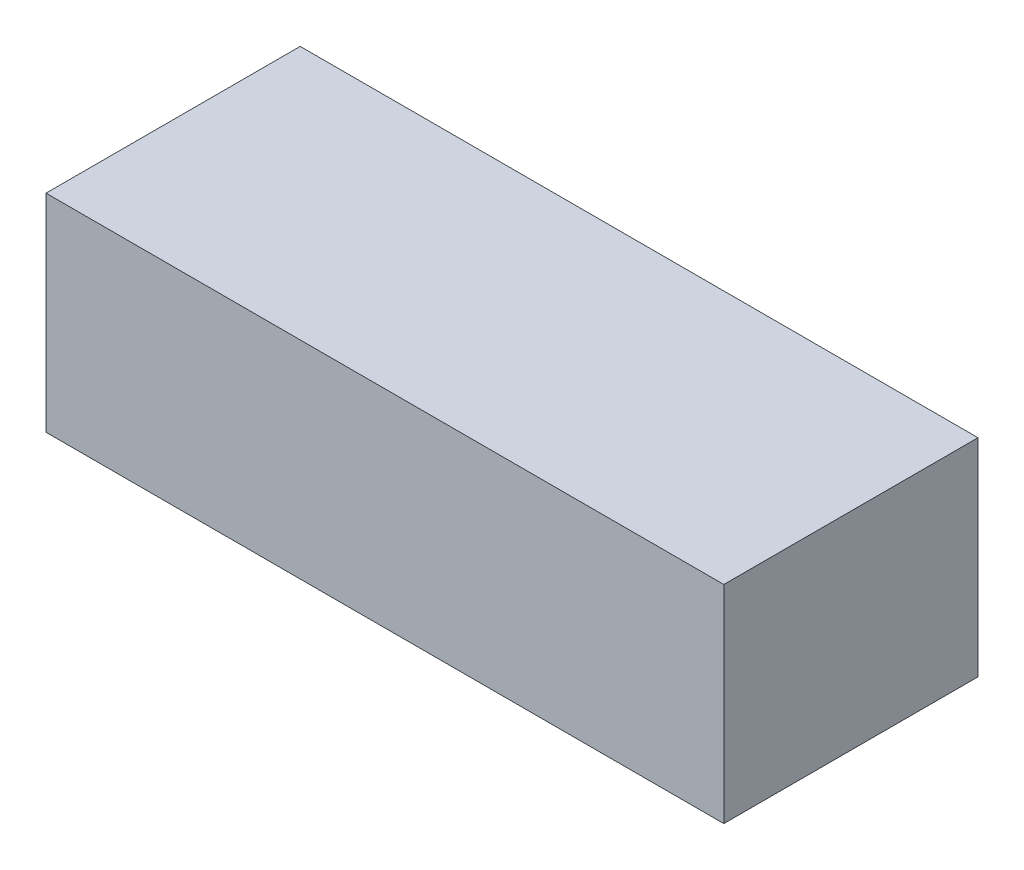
ISO-10303-21;
HEADER;
FILE_DESCRIPTION(('STEP AP214'),'2;1');
FILE_NAME('part.step','',(''),(''),'','','');
FILE_SCHEMA(('AUTOMOTIVE_DESIGN { 1 0 10303 214 1 1 1 1 }'));
ENDSEC;
DATA;
#1=APPLICATION_CONTEXT('core data for automotive mechanical design processes');
#2=APPLICATION_PROTOCOL_DEFINITION('international standard','automotive_design',2000,#1);
#3=PRODUCT_CONTEXT('',#1,'mechanical');
#4=PRODUCT('Part','Part','',(#3));
#5=PRODUCT_RELATED_PRODUCT_CATEGORY('part','',(#4));
#6=PRODUCT_DEFINITION_FORMATION('','',#4);
#7=PRODUCT_DEFINITION_CONTEXT('part definition',#1,'design');
#8=PRODUCT_DEFINITION('design','',#6,#7);
#9=PRODUCT_DEFINITION_SHAPE('','',#8);
#10=(LENGTH_UNIT() NAMED_UNIT(*) SI_UNIT(.MILLI.,.METRE.));
#11=(NAMED_UNIT(*) PLANE_ANGLE_UNIT() SI_UNIT($,.RADIAN.));
#12=(NAMED_UNIT(*) SI_UNIT($,.STERADIAN.) SOLID_ANGLE_UNIT());
#13=UNCERTAINTY_MEASURE_WITH_UNIT(LENGTH_MEASURE(1.E-05),#10,'distance_accuracy_value','');
#14=(GEOMETRIC_REPRESENTATION_CONTEXT(3) GLOBAL_UNCERTAINTY_ASSIGNED_CONTEXT((#13)) GLOBAL_UNIT_ASSIGNED_CONTEXT((#10,
#11,#12)) REPRESENTATION_CONTEXT('',''));
#15=CARTESIAN_POINT('',(0.,0.,0.));
#16=DIRECTION('',(0.,0.,1.));
#17=DIRECTION('',(1.,0.,0.));
#18=AXIS2_PLACEMENT_3D('',#15,#16,#17);
#19=CARTESIAN_POINT('',(0.,0.,13.5));
#20=DIRECTION('',(-1.,0.,0.));
#21=DIRECTION('',(0.,0.,1.));
#22=AXIS2_PLACEMENT_3D('',#19,#20,#21);
#23=PLANE('',#22);
#24=DIRECTION('',(0.,1.,0.));
#25=VECTOR('',#24,1.);
#26=CARTESIAN_POINT('',(0.,0.,0.));
#27=LINE('',#26,#25);
#28=CARTESIAN_POINT('',(0.,0.,0.));
#29=VERTEX_POINT('',#28);
#30=CARTESIAN_POINT('',(0.,11.,0.));
#31=VERTEX_POINT('',#30);
#32=EDGE_CURVE('E99',#29,#31,#27,.T.);
#33=ORIENTED_EDGE('',*,*,#32,.F.);
#34=DIRECTION('',(0.,0.,-1.));
#35=VECTOR('',#34,1.);
#36=CARTESIAN_POINT('',(0.,0.,13.5));
#37=LINE('',#36,#35);
#38=CARTESIAN_POINT('',(0.,0.,13.5));
#39=VERTEX_POINT('',#38);
#40=EDGE_CURVE('E11',#39,#29,#37,.T.);
#41=ORIENTED_EDGE('',*,*,#40,.F.);
#42=DIRECTION('',(0.,1.,0.));
#43=VECTOR('',#42,1.);
#44=CARTESIAN_POINT('',(0.,0.,13.5));
#45=LINE('',#44,#43);
#46=CARTESIAN_POINT('',(0.,11.,13.5));
#47=VERTEX_POINT('',#46);
#48=EDGE_CURVE('E94',#39,#47,#45,.T.);
#49=ORIENTED_EDGE('',*,*,#48,.T.);
#50=DIRECTION('',(0.,0.,-1.));
#51=VECTOR('',#50,1.);
#52=CARTESIAN_POINT('',(0.,11.,13.5));
#53=LINE('',#52,#51);
#54=EDGE_CURVE('E37',#47,#31,#53,.T.);
#55=ORIENTED_EDGE('',*,*,#54,.T.);
#56=EDGE_LOOP('',(#33,#41,#49,#55));
#57=FACE_BOUND('',#56,.T.);
#58=ADVANCED_FACE('F34',(#57),#23,.T.);
#59=CARTESIAN_POINT('',(0.,0.,13.5));
#60=DIRECTION('',(0.,1.,0.));
#61=DIRECTION('',(0.,0.,1.));
#62=AXIS2_PLACEMENT_3D('',#59,#60,#61);
#63=PLANE('',#62);
#64=DIRECTION('',(1.,0.,0.));
#65=VECTOR('',#64,1.);
#66=CARTESIAN_POINT('',(0.,0.,0.));
#67=LINE('',#66,#65);
#68=CARTESIAN_POINT('',(36.,0.,0.));
#69=VERTEX_POINT('',#68);
#70=EDGE_CURVE('E67',#29,#69,#67,.T.);
#71=ORIENTED_EDGE('',*,*,#70,.T.);
#72=DIRECTION('',(0.,0.,-1.));
#73=VECTOR('',#72,1.);
#74=CARTESIAN_POINT('',(36.,0.,13.5));
#75=LINE('',#74,#73);
#76=CARTESIAN_POINT('',(36.,0.,13.5));
#77=VERTEX_POINT('',#76);
#78=EDGE_CURVE('E43',#77,#69,#75,.T.);
#79=ORIENTED_EDGE('',*,*,#78,.F.);
#80=DIRECTION('',(1.,0.,0.));
#81=VECTOR('',#80,1.);
#82=CARTESIAN_POINT('',(0.,0.,13.5));
#83=LINE('',#82,#81);
#84=EDGE_CURVE('E84',#39,#77,#83,.T.);
#85=ORIENTED_EDGE('',*,*,#84,.F.);
#86=ORIENTED_EDGE('',*,*,#40,.T.);
#87=EDGE_LOOP('',(#71,#79,#85,#86));
#88=FACE_BOUND('',#87,.T.);
#89=ADVANCED_FACE('F109',(#88),#63,.F.);
#90=CARTESIAN_POINT('',(36.,0.,13.5));
#91=DIRECTION('',(-1.,0.,0.));
#92=DIRECTION('',(0.,0.,1.));
#93=AXIS2_PLACEMENT_3D('',#90,#91,#92);
#94=PLANE('',#93);
#95=DIRECTION('',(0.,1.,0.));
#96=VECTOR('',#95,1.);
#97=CARTESIAN_POINT('',(36.,0.,0.));
#98=LINE('',#97,#96);
#99=CARTESIAN_POINT('',(36.,11.,0.));
#100=VERTEX_POINT('',#99);
#101=EDGE_CURVE('E91',#69,#100,#98,.T.);
#102=ORIENTED_EDGE('',*,*,#101,.T.);
#103=DIRECTION('',(0.,0.,-1.));
#104=VECTOR('',#103,1.);
#105=CARTESIAN_POINT('',(36.,11.,13.5));
#106=LINE('',#105,#104);
#107=CARTESIAN_POINT('',(36.,11.,13.5));
#108=VERTEX_POINT('',#107);
#109=EDGE_CURVE('E88',#108,#100,#106,.T.);
#110=ORIENTED_EDGE('',*,*,#109,.F.);
#111=DIRECTION('',(0.,1.,0.));
#112=VECTOR('',#111,1.);
#113=CARTESIAN_POINT('',(36.,0.,13.5));
#114=LINE('',#113,#112);
#115=EDGE_CURVE('E79',#77,#108,#114,.T.);
#116=ORIENTED_EDGE('',*,*,#115,.F.);
#117=ORIENTED_EDGE('',*,*,#78,.T.);
#118=EDGE_LOOP('',(#102,#110,#116,#117));
#119=FACE_BOUND('',#118,.T.);
#120=ADVANCED_FACE('F89',(#119),#94,.F.);
#121=CARTESIAN_POINT('',(0.,11.,13.5));
#122=DIRECTION('',(0.,1.,0.));
#123=DIRECTION('',(0.,0.,1.));
#124=AXIS2_PLACEMENT_3D('',#121,#122,#123);
#125=PLANE('',#124);
#126=DIRECTION('',(1.,0.,0.));
#127=VECTOR('',#126,1.);
#128=CARTESIAN_POINT('',(0.,11.,0.));
#129=LINE('',#128,#127);
#130=EDGE_CURVE('E102',#31,#100,#129,.T.);
#131=ORIENTED_EDGE('',*,*,#130,.F.);
#132=ORIENTED_EDGE('',*,*,#54,.F.);
#133=DIRECTION('',(1.,0.,0.));
#134=VECTOR('',#133,1.);
#135=CARTESIAN_POINT('',(0.,11.,13.5));
#136=LINE('',#135,#134);
#137=EDGE_CURVE('E83',#47,#108,#136,.T.);
#138=ORIENTED_EDGE('',*,*,#137,.T.);
#139=ORIENTED_EDGE('',*,*,#109,.T.);
#140=EDGE_LOOP('',(#131,#132,#138,#139));
#141=FACE_BOUND('',#140,.T.);
#142=ADVANCED_FACE('F93',(#141),#125,.T.);
#143=CARTESIAN_POINT('',(0.,0.,13.5));
#144=DIRECTION('',(0.,0.,-1.));
#145=DIRECTION('',(-1.,0.,0.));
#146=AXIS2_PLACEMENT_3D('',#143,#144,#145);
#147=PLANE('',#146);
#148=ORIENTED_EDGE('',*,*,#48,.F.);
#149=ORIENTED_EDGE('',*,*,#84,.T.);
#150=ORIENTED_EDGE('',*,*,#115,.T.);
#151=ORIENTED_EDGE('',*,*,#137,.F.);
#152=EDGE_LOOP('',(#148,#149,#150,#151));
#153=FACE_BOUND('',#152,.T.);
#154=ADVANCED_FACE('F82',(#153),#147,.F.);
#155=CARTESIAN_POINT('',(0.,0.,0.));
#156=DIRECTION('',(0.,0.,-1.));
#157=DIRECTION('',(-1.,0.,0.));
#158=AXIS2_PLACEMENT_3D('',#155,#156,#157);
#159=PLANE('',#158);
#160=ORIENTED_EDGE('',*,*,#32,.T.);
#161=ORIENTED_EDGE('',*,*,#130,.T.);
#162=ORIENTED_EDGE('',*,*,#101,.F.);
#163=ORIENTED_EDGE('',*,*,#70,.F.);
#164=EDGE_LOOP('',(#160,#161,#162,#163));
#165=FACE_BOUND('',#164,.T.);
#166=ADVANCED_FACE('F107',(#165),#159,.T.);
#167=CLOSED_SHELL('',(#58,#89,#120,#142,#154,#166));
#168=MANIFOLD_SOLID_BREP('B2',#167);
#169=ADVANCED_BREP_SHAPE_REPRESENTATION('',(#18,#168),#14);
#170=SHAPE_DEFINITION_REPRESENTATION(#9,#169);
ENDSEC;
END-ISO-10303-21;
